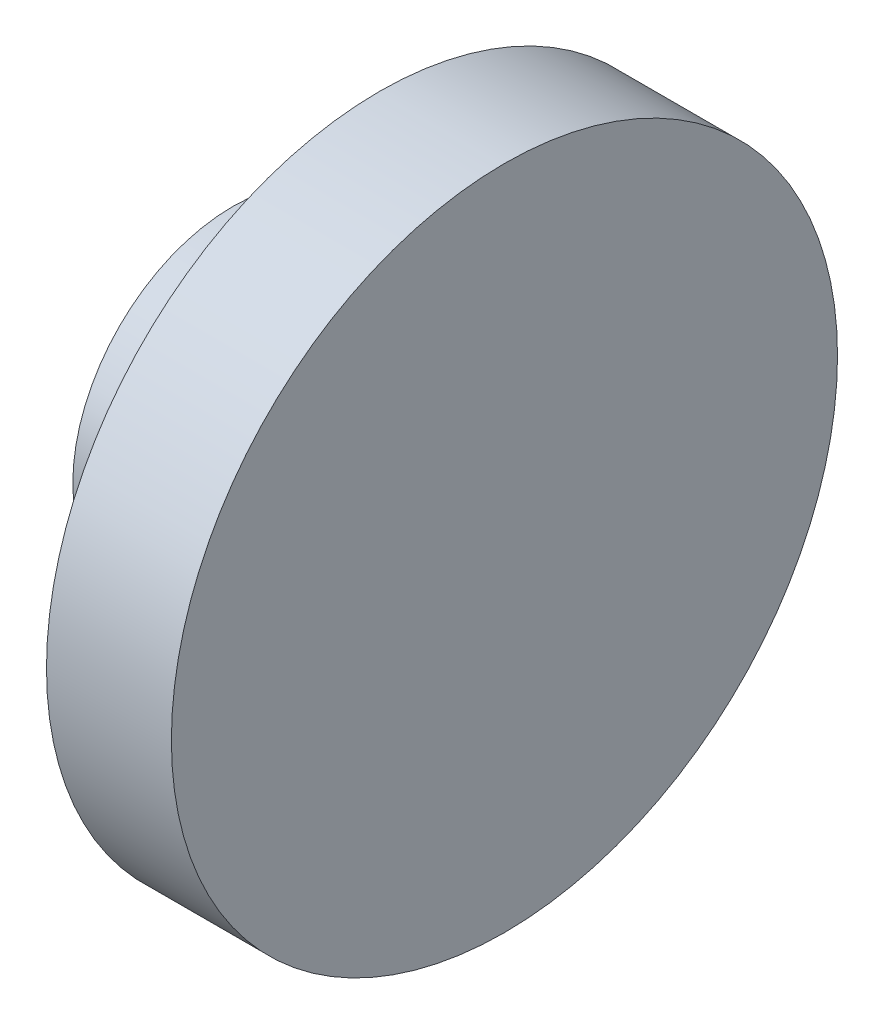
ISO-10303-21;
HEADER;
FILE_DESCRIPTION(('STEP AP214'),'2;1');
FILE_NAME('part.step','',(''),(''),'','','');
FILE_SCHEMA(('AUTOMOTIVE_DESIGN { 1 0 10303 214 1 1 1 1 }'));
ENDSEC;
DATA;
#1=APPLICATION_CONTEXT('core data for automotive mechanical design processes');
#2=APPLICATION_PROTOCOL_DEFINITION('international standard','automotive_design',2000,#1);
#3=PRODUCT_CONTEXT('',#1,'mechanical');
#4=PRODUCT('Part','Part','',(#3));
#5=PRODUCT_RELATED_PRODUCT_CATEGORY('part','',(#4));
#6=PRODUCT_DEFINITION_FORMATION('','',#4);
#7=PRODUCT_DEFINITION_CONTEXT('part definition',#1,'design');
#8=PRODUCT_DEFINITION('design','',#6,#7);
#9=PRODUCT_DEFINITION_SHAPE('','',#8);
#10=(LENGTH_UNIT() NAMED_UNIT(*) SI_UNIT(.MILLI.,.METRE.));
#11=(NAMED_UNIT(*) PLANE_ANGLE_UNIT() SI_UNIT($,.RADIAN.));
#12=(NAMED_UNIT(*) SI_UNIT($,.STERADIAN.) SOLID_ANGLE_UNIT());
#13=UNCERTAINTY_MEASURE_WITH_UNIT(LENGTH_MEASURE(1.E-05),#10,'distance_accuracy_value','');
#14=(GEOMETRIC_REPRESENTATION_CONTEXT(3) GLOBAL_UNCERTAINTY_ASSIGNED_CONTEXT((#13)) GLOBAL_UNIT_ASSIGNED_CONTEXT((#10,
#11,#12)) REPRESENTATION_CONTEXT('',''));
#15=CARTESIAN_POINT('',(0.,0.,0.));
#16=DIRECTION('',(0.,0.,1.));
#17=DIRECTION('',(1.,0.,0.));
#18=AXIS2_PLACEMENT_3D('',#15,#16,#17);
#19=CARTESIAN_POINT('',(-1.2954,0.,0.));
#20=DIRECTION('',(1.,0.,0.));
#21=DIRECTION('',(0.,0.,-1.));
#22=AXIS2_PLACEMENT_3D('',#19,#20,#21);
#23=PLANE('',#22);
#24=CARTESIAN_POINT('',(-1.2954,0.,0.));
#25=DIRECTION('',(-1.,0.,0.));
#26=DIRECTION('',(0.,0.,1.));
#27=AXIS2_PLACEMENT_3D('',#24,#25,#26);
#28=CIRCLE('',#27,0.595375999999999);
#29=CARTESIAN_POINT('',(-1.2954,0.,0.595375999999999));
#30=VERTEX_POINT('',#29);
#31=EDGE_CURVE('E49',#30,#30,#28,.T.);
#32=ORIENTED_EDGE('',*,*,#31,.F.);
#33=EDGE_LOOP('',(#32));
#34=FACE_BOUND('',#33,.T.);
#35=CARTESIAN_POINT('',(-1.2954,0.,0.));
#36=DIRECTION('',(-1.,0.,0.));
#37=DIRECTION('',(0.,0.,1.));
#38=AXIS2_PLACEMENT_3D('',#35,#36,#37);
#39=CIRCLE('',#38,1.524);
#40=CARTESIAN_POINT('',(-1.2954,0.,1.524));
#41=VERTEX_POINT('',#40);
#42=EDGE_CURVE('E11',#41,#41,#39,.T.);
#43=ORIENTED_EDGE('',*,*,#42,.T.);
#44=EDGE_LOOP('',(#43));
#45=FACE_BOUND('',#44,.T.);
#46=ADVANCED_FACE('F31',(#34,#45),#23,.F.);
#47=CARTESIAN_POINT('',(-2.77738833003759,0.,0.));
#48=DIRECTION('',(-1.,0.,0.));
#49=DIRECTION('',(0.,0.,1.));
#50=AXIS2_PLACEMENT_3D('',#47,#48,#49);
#51=CYLINDRICAL_SURFACE('',#50,1.524);
#52=ORIENTED_EDGE('',*,*,#42,.F.);
#53=EDGE_LOOP('',(#52));
#54=FACE_BOUND('',#53,.T.);
#55=CARTESIAN_POINT('',(0.104774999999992,0.,0.));
#56=DIRECTION('',(-1.,0.,0.));
#57=DIRECTION('',(0.,0.,1.));
#58=AXIS2_PLACEMENT_3D('',#55,#56,#57);
#59=CIRCLE('',#58,1.524);
#60=CARTESIAN_POINT('',(0.104774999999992,0.,1.524));
#61=VERTEX_POINT('',#60);
#62=EDGE_CURVE('E37',#61,#61,#59,.T.);
#63=ORIENTED_EDGE('',*,*,#62,.T.);
#64=EDGE_LOOP('',(#63));
#65=FACE_BOUND('',#64,.T.);
#66=ADVANCED_FACE('F62',(#54,#65),#51,.T.);
#67=CARTESIAN_POINT('',(0.104774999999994,1.524,0.));
#68=DIRECTION('',(1.,0.,0.));
#69=DIRECTION('',(0.,0.,-1.));
#70=AXIS2_PLACEMENT_3D('',#67,#68,#69);
#71=PLANE('',#70);
#72=ORIENTED_EDGE('',*,*,#62,.F.);
#73=EDGE_LOOP('',(#72));
#74=FACE_BOUND('',#73,.T.);
#75=CARTESIAN_POINT('',(0.104774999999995,0.,0.));
#76=DIRECTION('',(-1.,0.,0.));
#77=DIRECTION('',(0.,0.,1.));
#78=AXIS2_PLACEMENT_3D('',#75,#76,#77);
#79=CIRCLE('',#78,3.175);
#80=CARTESIAN_POINT('',(0.104774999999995,0.,3.175));
#81=VERTEX_POINT('',#80);
#82=EDGE_CURVE('E57',#81,#81,#79,.T.);
#83=ORIENTED_EDGE('',*,*,#82,.T.);
#84=EDGE_LOOP('',(#83));
#85=FACE_BOUND('',#84,.T.);
#86=ADVANCED_FACE('F64',(#74,#85),#71,.F.);
#87=CARTESIAN_POINT('',(-2.77738833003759,0.,0.));
#88=DIRECTION('',(-1.,0.,0.));
#89=DIRECTION('',(0.,0.,1.));
#90=AXIS2_PLACEMENT_3D('',#87,#88,#89);
#91=CYLINDRICAL_SURFACE('',#90,3.175);
#92=ORIENTED_EDGE('',*,*,#82,.F.);
#93=EDGE_LOOP('',(#92));
#94=FACE_BOUND('',#93,.T.);
#95=CARTESIAN_POINT('',(1.2954,0.,0.));
#96=DIRECTION('',(-1.,0.,0.));
#97=DIRECTION('',(0.,0.,1.));
#98=AXIS2_PLACEMENT_3D('',#95,#96,#97);
#99=CIRCLE('',#98,3.175);
#100=CARTESIAN_POINT('',(1.2954,0.,3.175));
#101=VERTEX_POINT('',#100);
#102=EDGE_CURVE('E52',#101,#101,#99,.T.);
#103=ORIENTED_EDGE('',*,*,#102,.T.);
#104=EDGE_LOOP('',(#103));
#105=FACE_BOUND('',#104,.T.);
#106=ADVANCED_FACE('F67',(#94,#105),#91,.T.);
#107=CARTESIAN_POINT('',(1.2954,3.175,0.));
#108=DIRECTION('',(-1.,0.,0.));
#109=DIRECTION('',(0.,0.,1.));
#110=AXIS2_PLACEMENT_3D('',#107,#108,#109);
#111=PLANE('',#110);
#112=ORIENTED_EDGE('',*,*,#102,.F.);
#113=EDGE_LOOP('',(#112));
#114=FACE_BOUND('',#113,.T.);
#115=ADVANCED_FACE('F73',(#114),#111,.F.);
#116=CARTESIAN_POINT('',(-1.2954,0.,0.));
#117=DIRECTION('',(-1.,0.,0.));
#118=DIRECTION('',(0.,0.,1.));
#119=AXIS2_PLACEMENT_3D('',#116,#117,#118);
#120=CYLINDRICAL_SURFACE('',#119,0.595375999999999);
#121=CARTESIAN_POINT('',(0.304800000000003,0.,0.));
#122=DIRECTION('',(-1.,0.,0.));
#123=DIRECTION('',(0.,0.,1.));
#124=AXIS2_PLACEMENT_3D('',#121,#122,#123);
#125=CIRCLE('',#124,0.595376);
#126=CARTESIAN_POINT('',(0.304800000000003,0.,0.595376));
#127=VERTEX_POINT('',#126);
#128=EDGE_CURVE('E47',#127,#127,#125,.T.);
#129=ORIENTED_EDGE('',*,*,#128,.F.);
#130=EDGE_LOOP('',(#129));
#131=FACE_BOUND('',#130,.T.);
#132=ORIENTED_EDGE('',*,*,#31,.T.);
#133=EDGE_LOOP('',(#132));
#134=FACE_BOUND('',#133,.T.);
#135=ADVANCED_FACE('F43',(#131,#134),#120,.F.);
#136=CARTESIAN_POINT('',(0.304800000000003,0.,0.));
#137=DIRECTION('',(-1.,0.,0.));
#138=DIRECTION('',(0.,0.,1.));
#139=AXIS2_PLACEMENT_3D('',#136,#137,#138);
#140=CONICAL_SURFACE('',#139,0.595376,1.02974425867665);
#141=CARTESIAN_POINT('',(0.662537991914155,0.,0.));
#142=VERTEX_POINT('',#141);
#143=VERTEX_LOOP('',#142);
#144=FACE_BOUND('',#143,.T.);
#145=ORIENTED_EDGE('',*,*,#128,.T.);
#146=EDGE_LOOP('',(#145));
#147=FACE_BOUND('',#146,.T.);
#148=ADVANCED_FACE('F40',(#144,#147),#140,.F.);
#149=CLOSED_SHELL('',(#46,#66,#86,#106,#115,#135,#148));
#150=MANIFOLD_SOLID_BREP('B2',#149);
#151=ADVANCED_BREP_SHAPE_REPRESENTATION('',(#18,#150),#14);
#152=SHAPE_DEFINITION_REPRESENTATION(#9,#151);
ENDSEC;
END-ISO-10303-21;
